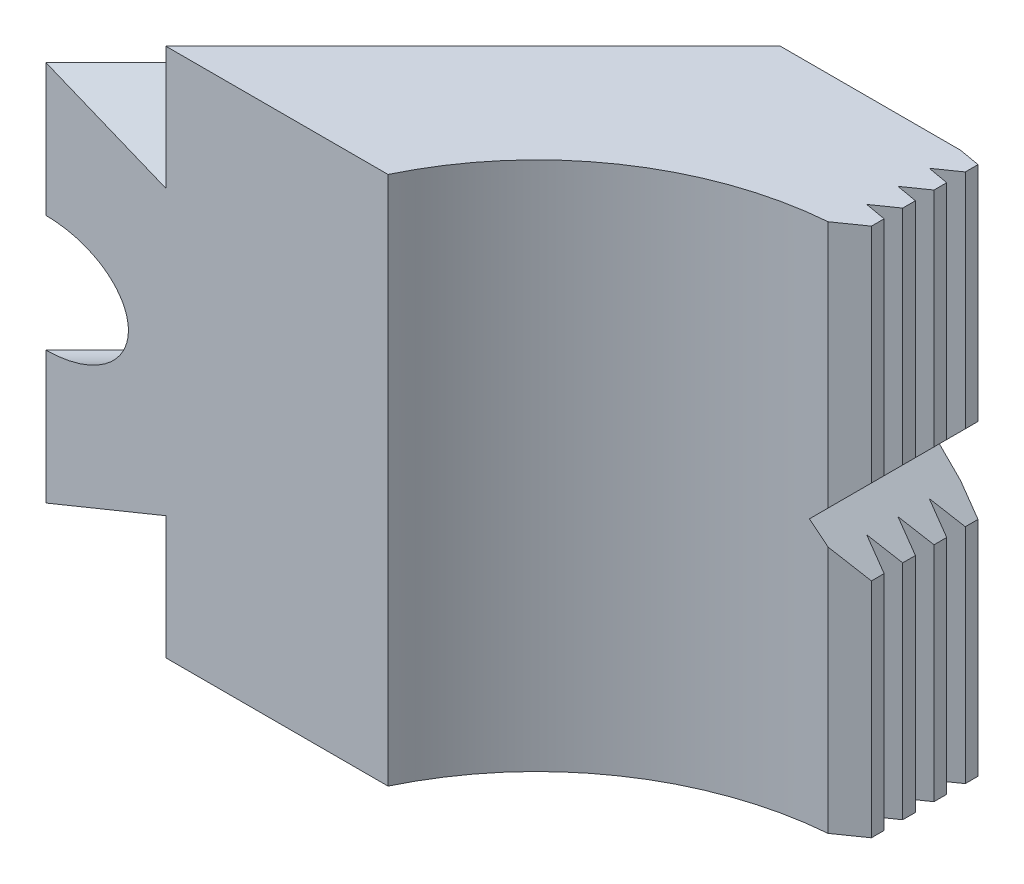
ISO-10303-21;
HEADER;
FILE_DESCRIPTION(('STEP AP214'),'2;1');
FILE_NAME('part.step','',(''),(''),'','','');
FILE_SCHEMA(('AUTOMOTIVE_DESIGN { 1 0 10303 214 1 1 1 1 }'));
ENDSEC;
DATA;
#1=APPLICATION_CONTEXT('core data for automotive mechanical design processes');
#2=APPLICATION_PROTOCOL_DEFINITION('international standard','automotive_design',2000,#1);
#3=PRODUCT_CONTEXT('',#1,'mechanical');
#4=PRODUCT('Part','Part','',(#3));
#5=PRODUCT_RELATED_PRODUCT_CATEGORY('part','',(#4));
#6=PRODUCT_DEFINITION_FORMATION('','',#4);
#7=PRODUCT_DEFINITION_CONTEXT('part definition',#1,'design');
#8=PRODUCT_DEFINITION('design','',#6,#7);
#9=PRODUCT_DEFINITION_SHAPE('','',#8);
#10=(LENGTH_UNIT() NAMED_UNIT(*) SI_UNIT(.MILLI.,.METRE.));
#11=(NAMED_UNIT(*) PLANE_ANGLE_UNIT() SI_UNIT($,.RADIAN.));
#12=(NAMED_UNIT(*) SI_UNIT($,.STERADIAN.) SOLID_ANGLE_UNIT());
#13=UNCERTAINTY_MEASURE_WITH_UNIT(LENGTH_MEASURE(1.E-05),#10,'distance_accuracy_value','');
#14=(GEOMETRIC_REPRESENTATION_CONTEXT(3) GLOBAL_UNCERTAINTY_ASSIGNED_CONTEXT((#13)) GLOBAL_UNIT_ASSIGNED_CONTEXT((#10,
#11,#12)) REPRESENTATION_CONTEXT('',''));
#15=CARTESIAN_POINT('',(0.,0.,0.));
#16=DIRECTION('',(0.,0.,1.));
#17=DIRECTION('',(1.,0.,0.));
#18=AXIS2_PLACEMENT_3D('',#15,#16,#17);
#19=CARTESIAN_POINT('',(-84.343578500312,6.69059892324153,90.0004329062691));
#20=DIRECTION('',(-0.707106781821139,0.,-0.707106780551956));
#21=DIRECTION('',(0.707106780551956,0.,-0.70710678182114));
#22=AXIS2_PLACEMENT_3D('',#19,#20,#21);
#23=PLANE('',#22);
#24=DIRECTION('',(0.,1.,0.));
#25=VECTOR('',#24,1.);
#26=CARTESIAN_POINT('',(5.65685424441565,12.5,0.));
#27=LINE('',#26,#25);
#28=CARTESIAN_POINT('',(5.65685424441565,6.69059892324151,0.));
#29=VERTEX_POINT('',#28);
#30=CARTESIAN_POINT('',(5.65685424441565,12.5,0.));
#31=VERTEX_POINT('',#30);
#32=EDGE_CURVE('E349',#29,#31,#27,.T.);
#33=ORIENTED_EDGE('',*,*,#32,.F.);
#34=DIRECTION('',(0.707106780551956,0.,-0.707106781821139));
#35=VECTOR('',#34,1.);
#36=CARTESIAN_POINT('',(-84.343578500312,6.69059892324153,90.0004329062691));
#37=LINE('',#36,#35);
#38=CARTESIAN_POINT('',(-8.8431457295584,6.69059892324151,14.5));
#39=VERTEX_POINT('',#38);
#40=EDGE_CURVE('E344',#39,#29,#37,.T.);
#41=ORIENTED_EDGE('',*,*,#40,.F.);
#42=DIRECTION('',(0.,-1.,0.));
#43=VECTOR('',#42,1.);
#44=CARTESIAN_POINT('',(-8.8431457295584,12.5,14.5));
#45=LINE('',#44,#43);
#46=CARTESIAN_POINT('',(-8.8431457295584,12.5,14.5));
#47=VERTEX_POINT('',#46);
#48=EDGE_CURVE('E337',#47,#39,#45,.T.);
#49=ORIENTED_EDGE('',*,*,#48,.F.);
#50=DIRECTION('',(-0.707106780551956,0.,0.70710678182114));
#51=VECTOR('',#50,1.);
#52=CARTESIAN_POINT('',(-0.0915728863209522,12.5,5.74842714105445));
#53=LINE('',#52,#51);
#54=EDGE_CURVE('E319',#31,#47,#53,.T.);
#55=ORIENTED_EDGE('',*,*,#54,.F.);
#56=EDGE_LOOP('',(#33,#41,#49,#55));
#57=FACE_BOUND('',#56,.T.);
#58=ADVANCED_FACE('F14',(#57),#23,.T.);
#59=CARTESIAN_POINT('',(-84.343578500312,6.69059892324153,90.0004329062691));
#60=DIRECTION('',(0.353553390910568,0.86602540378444,0.353553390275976));
#61=DIRECTION('',(-0.925820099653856,0.377964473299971,0.));
#62=AXIS2_PLACEMENT_3D('',#59,#60,#61);
#63=PLANE('',#62);
#64=DIRECTION('',(0.925820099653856,-0.377964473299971,0.));
#65=VECTOR('',#64,1.);
#66=CARTESIAN_POINT('',(-1.22474487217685,9.50000000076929,0.));
#67=LINE('',#66,#65);
#68=CARTESIAN_POINT('',(0.,9.,0.));
#69=VERTEX_POINT('',#68);
#70=EDGE_CURVE('E366',#69,#29,#67,.T.);
#71=ORIENTED_EDGE('',*,*,#70,.F.);
#72=DIRECTION('',(0.707106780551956,0.,-0.707106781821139));
#73=VECTOR('',#72,1.);
#74=CARTESIAN_POINT('',(-87.1720056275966,9.,87.1720057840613));
#75=LINE('',#74,#73);
#76=CARTESIAN_POINT('',(-14.499999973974,9.,14.5));
#77=VERTEX_POINT('',#76);
#78=EDGE_CURVE('E346',#77,#69,#75,.T.);
#79=ORIENTED_EDGE('',*,*,#78,.F.);
#80=DIRECTION('',(-0.925820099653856,0.377964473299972,0.));
#81=VECTOR('',#80,1.);
#82=CARTESIAN_POINT('',(-1.88917844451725,3.85165366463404,14.5));
#83=LINE('',#82,#81);
#84=EDGE_CURVE('E22',#39,#77,#83,.T.);
#85=ORIENTED_EDGE('',*,*,#84,.F.);
#86=ORIENTED_EDGE('',*,*,#40,.T.);
#87=EDGE_LOOP('',(#71,#79,#85,#86));
#88=FACE_BOUND('',#87,.T.);
#89=ADVANCED_FACE('F343',(#88),#63,.T.);
#90=CARTESIAN_POINT('',(-84.343578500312,-6.69059892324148,90.0004329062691));
#91=DIRECTION('',(-0.707106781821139,0.,-0.707106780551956));
#92=DIRECTION('',(0.707106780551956,0.,-0.70710678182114));
#93=AXIS2_PLACEMENT_3D('',#90,#91,#92);
#94=PLANE('',#93);
#95=DIRECTION('',(0.,1.,0.));
#96=VECTOR('',#95,1.);
#97=CARTESIAN_POINT('',(5.65685424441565,12.5,0.));
#98=LINE('',#97,#96);
#99=CARTESIAN_POINT('',(5.65685424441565,-12.5,0.));
#100=VERTEX_POINT('',#99);
#101=CARTESIAN_POINT('',(5.6568542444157,-6.69059892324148,0.));
#102=VERTEX_POINT('',#101);
#103=EDGE_CURVE('E29',#100,#102,#98,.T.);
#104=ORIENTED_EDGE('',*,*,#103,.F.);
#105=DIRECTION('',(-0.707106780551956,0.,0.70710678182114));
#106=VECTOR('',#105,1.);
#107=CARTESIAN_POINT('',(-0.0915728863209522,-12.5,5.74842714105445));
#108=LINE('',#107,#106);
#109=CARTESIAN_POINT('',(-8.8431457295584,-12.5,14.5));
#110=VERTEX_POINT('',#109);
#111=EDGE_CURVE('E327',#100,#110,#108,.T.);
#112=ORIENTED_EDGE('',*,*,#111,.T.);
#113=DIRECTION('',(0.,-1.,0.));
#114=VECTOR('',#113,1.);
#115=CARTESIAN_POINT('',(-8.8431457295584,12.5,14.5));
#116=LINE('',#115,#114);
#117=CARTESIAN_POINT('',(-8.8431457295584,-6.69059892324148,14.5));
#118=VERTEX_POINT('',#117);
#119=EDGE_CURVE('E362',#118,#110,#116,.T.);
#120=ORIENTED_EDGE('',*,*,#119,.F.);
#121=DIRECTION('',(0.707106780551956,0.,-0.707106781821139));
#122=VECTOR('',#121,1.);
#123=CARTESIAN_POINT('',(-84.343578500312,-6.69059892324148,90.0004329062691));
#124=LINE('',#123,#122);
#125=EDGE_CURVE('E357',#118,#102,#124,.T.);
#126=ORIENTED_EDGE('',*,*,#125,.T.);
#127=EDGE_LOOP('',(#104,#112,#120,#126));
#128=FACE_BOUND('',#127,.T.);
#129=ADVANCED_FACE('F685',(#128),#94,.T.);
#130=CARTESIAN_POINT('',(-84.343578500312,-6.69059892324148,90.0004329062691));
#131=DIRECTION('',(0.353553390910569,-0.86602540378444,0.353553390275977));
#132=DIRECTION('',(0.925820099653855,0.377964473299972,0.));
#133=AXIS2_PLACEMENT_3D('',#130,#131,#132);
#134=PLANE('',#133);
#135=DIRECTION('',(-0.925820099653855,-0.377964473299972,0.));
#136=VECTOR('',#135,1.);
#137=CARTESIAN_POINT('',(7.52343278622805,-5.92857142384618,0.));
#138=LINE('',#137,#136);
#139=CARTESIAN_POINT('',(0.,-9.,0.));
#140=VERTEX_POINT('',#139);
#141=EDGE_CURVE('E368',#102,#140,#138,.T.);
#142=ORIENTED_EDGE('',*,*,#141,.F.);
#143=ORIENTED_EDGE('',*,*,#125,.F.);
#144=DIRECTION('',(0.925820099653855,0.377964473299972,0.));
#145=VECTOR('',#144,1.);
#146=CARTESIAN_POINT('',(6.8589992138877,-0.280225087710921,14.5));
#147=LINE('',#146,#145);
#148=CARTESIAN_POINT('',(-14.499999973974,-9.,14.5));
#149=VERTEX_POINT('',#148);
#150=EDGE_CURVE('E9',#149,#118,#147,.T.);
#151=ORIENTED_EDGE('',*,*,#150,.F.);
#152=DIRECTION('',(0.707106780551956,0.,-0.707106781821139));
#153=VECTOR('',#152,1.);
#154=CARTESIAN_POINT('',(-87.1720056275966,-9.,87.1720057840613));
#155=LINE('',#154,#153);
#156=EDGE_CURVE('E351',#149,#140,#155,.T.);
#157=ORIENTED_EDGE('',*,*,#156,.T.);
#158=EDGE_LOOP('',(#142,#143,#151,#157));
#159=FACE_BOUND('',#158,.T.);
#160=ADVANCED_FACE('F687',(#159),#134,.T.);
#161=CARTESIAN_POINT('',(-2.01227923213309E-13,12.5,0.));
#162=DIRECTION('',(0.,0.,-1.));
#163=DIRECTION('',(-1.,0.,0.));
#164=AXIS2_PLACEMENT_3D('',#161,#162,#163);
#165=PLANE('',#164);
#166=DIRECTION('',(1.,0.,0.));
#167=VECTOR('',#166,1.);
#168=CARTESIAN_POINT('',(-2.01227923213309E-13,-12.5,0.));
#169=LINE('',#168,#167);
#170=CARTESIAN_POINT('',(14.1599999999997,-12.5,0.));
#171=VERTEX_POINT('',#170);
#172=EDGE_CURVE('E484',#100,#171,#169,.T.);
#173=ORIENTED_EDGE('',*,*,#172,.F.);
#174=ORIENTED_EDGE('',*,*,#103,.T.);
#175=ORIENTED_EDGE('',*,*,#141,.T.);
#176=DIRECTION('',(0.,-1.,0.));
#177=VECTOR('',#176,1.);
#178=CARTESIAN_POINT('',(-2.01227923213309E-13,12.5,0.));
#179=LINE('',#178,#177);
#180=EDGE_CURVE('E37',#69,#140,#179,.T.);
#181=ORIENTED_EDGE('',*,*,#180,.F.);
#182=ORIENTED_EDGE('',*,*,#70,.T.);
#183=ORIENTED_EDGE('',*,*,#32,.T.);
#184=DIRECTION('',(1.,0.,0.));
#185=VECTOR('',#184,1.);
#186=CARTESIAN_POINT('',(-2.01227923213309E-13,12.5,0.));
#187=LINE('',#186,#185);
#188=CARTESIAN_POINT('',(14.1599999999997,12.5,0.));
#189=VERTEX_POINT('',#188);
#190=EDGE_CURVE('E527',#31,#189,#187,.T.);
#191=ORIENTED_EDGE('',*,*,#190,.T.);
#192=DIRECTION('',(0.,-1.,0.));
#193=VECTOR('',#192,1.);
#194=CARTESIAN_POINT('',(14.1599999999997,12.5,0.));
#195=LINE('',#194,#193);
#196=CARTESIAN_POINT('',(14.1599999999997,0.999999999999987,0.));
#197=VERTEX_POINT('',#196);
#198=EDGE_CURVE('E533',#189,#197,#195,.T.);
#199=ORIENTED_EDGE('',*,*,#198,.T.);
#200=DIRECTION('',(-0.707106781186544,-0.707106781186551,0.));
#201=VECTOR('',#200,1.);
#202=CARTESIAN_POINT('',(15.4999999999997,2.34,0.));
#203=LINE('',#202,#201);
#204=CARTESIAN_POINT('',(13.1599999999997,0.,0.));
#205=VERTEX_POINT('',#204);
#206=EDGE_CURVE('E370',#197,#205,#203,.T.);
#207=ORIENTED_EDGE('',*,*,#206,.T.);
#208=DIRECTION('',(-0.707106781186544,0.707106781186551,0.));
#209=VECTOR('',#208,1.);
#210=CARTESIAN_POINT('',(15.4999999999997,-2.34,0.));
#211=LINE('',#210,#209);
#212=CARTESIAN_POINT('',(14.1599999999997,-1.,0.));
#213=VERTEX_POINT('',#212);
#214=EDGE_CURVE('E371',#213,#205,#211,.T.);
#215=ORIENTED_EDGE('',*,*,#214,.F.);
#216=EDGE_CURVE('E532',#213,#171,#195,.T.);
#217=ORIENTED_EDGE('',*,*,#216,.T.);
#218=EDGE_LOOP('',(#173,#174,#175,#181,#182,#183,#191,#199,#207,#215,#217));
#219=FACE_BOUND('',#218,.T.);
#220=ADVANCED_FACE('F691',(#219),#165,.T.);
#221=CARTESIAN_POINT('',(1.6414941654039,12.5,14.5));
#222=DIRECTION('',(0.,0.,1.));
#223=DIRECTION('',(1.,0.,0.));
#224=AXIS2_PLACEMENT_3D('',#221,#222,#223);
#225=PLANE('',#224);
#226=ORIENTED_EDGE('',*,*,#150,.T.);
#227=ORIENTED_EDGE('',*,*,#119,.T.);
#228=DIRECTION('',(-1.,0.,0.));
#229=VECTOR('',#228,1.);
#230=CARTESIAN_POINT('',(1.6414941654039,-12.5,14.5));
#231=LINE('',#230,#229);
#232=CARTESIAN_POINT('',(1.6414941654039,-12.5,14.5));
#233=VERTEX_POINT('',#232);
#234=EDGE_CURVE('E443',#233,#110,#231,.T.);
#235=ORIENTED_EDGE('',*,*,#234,.F.);
#236=DIRECTION('',(0.,-1.,0.));
#237=VECTOR('',#236,1.);
#238=CARTESIAN_POINT('',(1.6414941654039,12.5,14.5));
#239=LINE('',#238,#237);
#240=CARTESIAN_POINT('',(1.6414941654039,12.5,14.5));
#241=VERTEX_POINT('',#240);
#242=EDGE_CURVE('E304',#241,#233,#239,.T.);
#243=ORIENTED_EDGE('',*,*,#242,.F.);
#244=DIRECTION('',(-1.,0.,0.));
#245=VECTOR('',#244,1.);
#246=CARTESIAN_POINT('',(1.6414941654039,12.5,14.5));
#247=LINE('',#246,#245);
#248=EDGE_CURVE('E447',#241,#47,#247,.T.);
#249=ORIENTED_EDGE('',*,*,#248,.T.);
#250=ORIENTED_EDGE('',*,*,#48,.T.);
#251=ORIENTED_EDGE('',*,*,#84,.T.);
#252=DIRECTION('',(0.,-1.,0.));
#253=VECTOR('',#252,1.);
#254=CARTESIAN_POINT('',(-14.5000000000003,12.5,14.5));
#255=LINE('',#254,#253);
#256=CARTESIAN_POINT('',(-14.5000000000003,2.75,14.5));
#257=VERTEX_POINT('',#256);
#258=EDGE_CURVE('E334',#77,#257,#255,.T.);
#259=ORIENTED_EDGE('',*,*,#258,.T.);
#260=CARTESIAN_POINT('',(-14.5000000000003,0.,14.5));
#261=DIRECTION('',(0.,0.,1.));
#262=DIRECTION('',(-1.,0.,0.));
#263=AXIS2_PLACEMENT_3D('',#260,#261,#262);
#264=ELLIPSE('',#263,3.88908729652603,2.75);
#265=CARTESIAN_POINT('',(-14.5000000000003,-2.75,14.5));
#266=VERTEX_POINT('',#265);
#267=EDGE_CURVE('E441',#266,#257,#264,.T.);
#268=ORIENTED_EDGE('',*,*,#267,.F.);
#269=EDGE_CURVE('E490',#266,#149,#255,.T.);
#270=ORIENTED_EDGE('',*,*,#269,.T.);
#271=EDGE_LOOP('',(#226,#227,#235,#243,#249,#250,#251,#259,#268,#270));
#272=FACE_BOUND('',#271,.T.);
#273=ADVANCED_FACE('F332',(#272),#225,.T.);
#274=CARTESIAN_POINT('',(15.1599999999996,-12.5,21.));
#275=DIRECTION('',(0.,1.,0.));
#276=DIRECTION('',(0.,0.,1.));
#277=AXIS2_PLACEMENT_3D('',#274,#275,#276);
#278=PLANE('',#277);
#279=ORIENTED_EDGE('',*,*,#111,.F.);
#280=ORIENTED_EDGE('',*,*,#172,.T.);
#281=DIRECTION('',(0.984807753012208,0.,0.173648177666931));
#282=VECTOR('',#281,1.);
#283=CARTESIAN_POINT('',(14.1599999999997,-12.5,0.));
#284=LINE('',#283,#282);
#285=CARTESIAN_POINT('',(15.1599999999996,-12.5,0.176326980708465));
#286=VERTEX_POINT('',#285);
#287=EDGE_CURVE('E481',#171,#286,#284,.T.);
#288=ORIENTED_EDGE('',*,*,#287,.T.);
#289=DIRECTION('',(0.,0.,1.));
#290=VECTOR('',#289,1.);
#291=CARTESIAN_POINT('',(15.1599999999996,-12.5,0.176326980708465));
#292=LINE('',#291,#290);
#293=CARTESIAN_POINT('',(15.1599999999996,-12.5,0.776326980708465));
#294=VERTEX_POINT('',#293);
#295=EDGE_CURVE('E478',#286,#294,#292,.T.);
#296=ORIENTED_EDGE('',*,*,#295,.T.);
#297=DIRECTION('',(-0.819152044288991,0.,0.573576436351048));
#298=VECTOR('',#297,1.);
#299=CARTESIAN_POINT('',(15.1599999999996,-12.5,0.776326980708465));
#300=LINE('',#299,#298);
#301=CARTESIAN_POINT('',(14.1599999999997,-12.5,1.47653451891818));
#302=VERTEX_POINT('',#301);
#303=EDGE_CURVE('E475',#294,#302,#300,.T.);
#304=ORIENTED_EDGE('',*,*,#303,.T.);
#305=DIRECTION('',(0.984807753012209,0.,0.173648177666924));
#306=VECTOR('',#305,1.);
#307=CARTESIAN_POINT('',(14.1599999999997,-12.5,1.47653451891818));
#308=LINE('',#307,#306);
#309=CARTESIAN_POINT('',(15.1599999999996,-12.5,1.65286149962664));
#310=VERTEX_POINT('',#309);
#311=EDGE_CURVE('E472',#302,#310,#308,.T.);
#312=ORIENTED_EDGE('',*,*,#311,.T.);
#313=DIRECTION('',(0.,0.,1.));
#314=VECTOR('',#313,1.);
#315=CARTESIAN_POINT('',(15.1599999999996,-12.5,1.65286149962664));
#316=LINE('',#315,#314);
#317=CARTESIAN_POINT('',(15.1599999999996,-12.5,2.25286149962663));
#318=VERTEX_POINT('',#317);
#319=EDGE_CURVE('E469',#310,#318,#316,.T.);
#320=ORIENTED_EDGE('',*,*,#319,.T.);
#321=DIRECTION('',(-0.819152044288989,0.,0.57357643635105));
#322=VECTOR('',#321,1.);
#323=CARTESIAN_POINT('',(15.1599999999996,-12.5,2.25286149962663));
#324=LINE('',#323,#322);
#325=CARTESIAN_POINT('',(14.1599999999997,-12.5,2.95306903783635));
#326=VERTEX_POINT('',#325);
#327=EDGE_CURVE('E466',#318,#326,#324,.T.);
#328=ORIENTED_EDGE('',*,*,#327,.T.);
#329=DIRECTION('',(0.984807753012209,0.,0.173648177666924));
#330=VECTOR('',#329,1.);
#331=CARTESIAN_POINT('',(14.1599999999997,-12.5,2.95306903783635));
#332=LINE('',#331,#330);
#333=CARTESIAN_POINT('',(15.1599999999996,-12.5,3.12939601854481));
#334=VERTEX_POINT('',#333);
#335=EDGE_CURVE('E463',#326,#334,#332,.T.);
#336=ORIENTED_EDGE('',*,*,#335,.T.);
#337=DIRECTION('',(0.,0.,1.));
#338=VECTOR('',#337,1.);
#339=CARTESIAN_POINT('',(15.1599999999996,-12.5,3.12939601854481));
#340=LINE('',#339,#338);
#341=CARTESIAN_POINT('',(15.1599999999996,-12.5,3.72939601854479));
#342=VERTEX_POINT('',#341);
#343=EDGE_CURVE('E460',#334,#342,#340,.T.);
#344=ORIENTED_EDGE('',*,*,#343,.T.);
#345=DIRECTION('',(-0.819152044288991,0.,0.573576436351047));
#346=VECTOR('',#345,1.);
#347=CARTESIAN_POINT('',(15.1599999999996,-12.5,3.72939601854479));
#348=LINE('',#347,#346);
#349=CARTESIAN_POINT('',(14.1599999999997,-12.5,4.4296035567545));
#350=VERTEX_POINT('',#349);
#351=EDGE_CURVE('E457',#342,#350,#348,.T.);
#352=ORIENTED_EDGE('',*,*,#351,.T.);
#353=DIRECTION('',(0.984807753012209,0.,0.173648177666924));
#354=VECTOR('',#353,1.);
#355=CARTESIAN_POINT('',(14.1599999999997,-12.5,4.4296035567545));
#356=LINE('',#355,#354);
#357=CARTESIAN_POINT('',(15.1599999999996,-12.5,4.60593053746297));
#358=VERTEX_POINT('',#357);
#359=EDGE_CURVE('E454',#350,#358,#356,.T.);
#360=ORIENTED_EDGE('',*,*,#359,.T.);
#361=DIRECTION('',(0.,0.,1.));
#362=VECTOR('',#361,1.);
#363=CARTESIAN_POINT('',(15.1599999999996,-12.5,4.60593053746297));
#364=LINE('',#363,#362);
#365=CARTESIAN_POINT('',(15.1599999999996,-12.5,5.20593053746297));
#366=VERTEX_POINT('',#365);
#367=EDGE_CURVE('E451',#358,#366,#364,.T.);
#368=ORIENTED_EDGE('',*,*,#367,.T.);
#369=DIRECTION('',(-0.81915204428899,0.,0.573576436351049));
#370=VECTOR('',#369,1.);
#371=CARTESIAN_POINT('',(15.1599999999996,-12.5,5.20593053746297));
#372=LINE('',#371,#370);
#373=CARTESIAN_POINT('',(13.9569388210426,-12.5,6.04832304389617));
#374=VERTEX_POINT('',#373);
#375=EDGE_CURVE('E448',#366,#374,#372,.T.);
#376=ORIENTED_EDGE('',*,*,#375,.T.);
#377=CARTESIAN_POINT('',(15.1599999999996,-12.5,21.));
#378=DIRECTION('',(0.,1.,0.));
#379=DIRECTION('',(0.,0.,1.));
#380=AXIS2_PLACEMENT_3D('',#377,#378,#379);
#381=CIRCLE('',#380,15.);
#382=EDGE_CURVE('E444',#374,#233,#381,.T.);
#383=ORIENTED_EDGE('',*,*,#382,.T.);
#384=ORIENTED_EDGE('',*,*,#234,.T.);
#385=EDGE_LOOP('',(#279,#280,#288,#296,#304,#312,#320,#328,#336,#344,#352,#360,#368,#376,#383,#384));
#386=FACE_BOUND('',#385,.T.);
#387=ADVANCED_FACE('F709',(#386),#278,.F.);
#388=CARTESIAN_POINT('',(15.1599999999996,12.5,21.));
#389=DIRECTION('',(0.,1.,0.));
#390=DIRECTION('',(0.,0.,1.));
#391=AXIS2_PLACEMENT_3D('',#388,#389,#390);
#392=PLANE('',#391);
#393=ORIENTED_EDGE('',*,*,#190,.F.);
#394=ORIENTED_EDGE('',*,*,#54,.T.);
#395=ORIENTED_EDGE('',*,*,#248,.F.);
#396=CARTESIAN_POINT('',(15.1599999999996,12.5,21.));
#397=DIRECTION('',(0.,1.,0.));
#398=DIRECTION('',(0.,0.,1.));
#399=AXIS2_PLACEMENT_3D('',#396,#397,#398);
#400=CIRCLE('',#399,15.);
#401=CARTESIAN_POINT('',(13.9569388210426,12.5,6.04832304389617));
#402=VERTEX_POINT('',#401);
#403=EDGE_CURVE('E487',#402,#241,#400,.T.);
#404=ORIENTED_EDGE('',*,*,#403,.F.);
#405=DIRECTION('',(-0.81915204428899,0.,0.573576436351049));
#406=VECTOR('',#405,1.);
#407=CARTESIAN_POINT('',(15.1599999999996,12.5,5.20593053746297));
#408=LINE('',#407,#406);
#409=CARTESIAN_POINT('',(15.1599999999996,12.5,5.20593053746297));
#410=VERTEX_POINT('',#409);
#411=EDGE_CURVE('E491',#410,#402,#408,.T.);
#412=ORIENTED_EDGE('',*,*,#411,.F.);
#413=DIRECTION('',(0.,0.,1.));
#414=VECTOR('',#413,1.);
#415=CARTESIAN_POINT('',(15.1599999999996,12.5,4.60593053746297));
#416=LINE('',#415,#414);
#417=CARTESIAN_POINT('',(15.1599999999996,12.5,4.60593053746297));
#418=VERTEX_POINT('',#417);
#419=EDGE_CURVE('E494',#418,#410,#416,.T.);
#420=ORIENTED_EDGE('',*,*,#419,.F.);
#421=DIRECTION('',(0.984807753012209,0.,0.173648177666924));
#422=VECTOR('',#421,1.);
#423=CARTESIAN_POINT('',(14.1599999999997,12.5,4.4296035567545));
#424=LINE('',#423,#422);
#425=CARTESIAN_POINT('',(14.1599999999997,12.5,4.4296035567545));
#426=VERTEX_POINT('',#425);
#427=EDGE_CURVE('E497',#426,#418,#424,.T.);
#428=ORIENTED_EDGE('',*,*,#427,.F.);
#429=DIRECTION('',(-0.819152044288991,0.,0.573576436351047));
#430=VECTOR('',#429,1.);
#431=CARTESIAN_POINT('',(15.1599999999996,12.5,3.72939601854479));
#432=LINE('',#431,#430);
#433=CARTESIAN_POINT('',(15.1599999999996,12.5,3.72939601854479));
#434=VERTEX_POINT('',#433);
#435=EDGE_CURVE('E500',#434,#426,#432,.T.);
#436=ORIENTED_EDGE('',*,*,#435,.F.);
#437=DIRECTION('',(0.,0.,1.));
#438=VECTOR('',#437,1.);
#439=CARTESIAN_POINT('',(15.1599999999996,12.5,3.12939601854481));
#440=LINE('',#439,#438);
#441=CARTESIAN_POINT('',(15.1599999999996,12.5,3.12939601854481));
#442=VERTEX_POINT('',#441);
#443=EDGE_CURVE('E503',#442,#434,#440,.T.);
#444=ORIENTED_EDGE('',*,*,#443,.F.);
#445=DIRECTION('',(0.984807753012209,0.,0.173648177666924));
#446=VECTOR('',#445,1.);
#447=CARTESIAN_POINT('',(14.1599999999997,12.5,2.95306903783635));
#448=LINE('',#447,#446);
#449=CARTESIAN_POINT('',(14.1599999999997,12.5,2.95306903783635));
#450=VERTEX_POINT('',#449);
#451=EDGE_CURVE('E506',#450,#442,#448,.T.);
#452=ORIENTED_EDGE('',*,*,#451,.F.);
#453=DIRECTION('',(-0.819152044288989,0.,0.57357643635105));
#454=VECTOR('',#453,1.);
#455=CARTESIAN_POINT('',(15.1599999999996,12.5,2.25286149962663));
#456=LINE('',#455,#454);
#457=CARTESIAN_POINT('',(15.1599999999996,12.5,2.25286149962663));
#458=VERTEX_POINT('',#457);
#459=EDGE_CURVE('E509',#458,#450,#456,.T.);
#460=ORIENTED_EDGE('',*,*,#459,.F.);
#461=DIRECTION('',(0.,0.,1.));
#462=VECTOR('',#461,1.);
#463=CARTESIAN_POINT('',(15.1599999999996,12.5,1.65286149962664));
#464=LINE('',#463,#462);
#465=CARTESIAN_POINT('',(15.1599999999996,12.5,1.65286149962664));
#466=VERTEX_POINT('',#465);
#467=EDGE_CURVE('E512',#466,#458,#464,.T.);
#468=ORIENTED_EDGE('',*,*,#467,.F.);
#469=DIRECTION('',(0.984807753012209,0.,0.173648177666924));
#470=VECTOR('',#469,1.);
#471=CARTESIAN_POINT('',(14.1599999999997,12.5,1.47653451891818));
#472=LINE('',#471,#470);
#473=CARTESIAN_POINT('',(14.1599999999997,12.5,1.47653451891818));
#474=VERTEX_POINT('',#473);
#475=EDGE_CURVE('E515',#474,#466,#472,.T.);
#476=ORIENTED_EDGE('',*,*,#475,.F.);
#477=DIRECTION('',(-0.819152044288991,0.,0.573576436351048));
#478=VECTOR('',#477,1.);
#479=CARTESIAN_POINT('',(15.1599999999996,12.5,0.776326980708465));
#480=LINE('',#479,#478);
#481=CARTESIAN_POINT('',(15.1599999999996,12.5,0.776326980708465));
#482=VERTEX_POINT('',#481);
#483=EDGE_CURVE('E518',#482,#474,#480,.T.);
#484=ORIENTED_EDGE('',*,*,#483,.F.);
#485=DIRECTION('',(0.,0.,1.));
#486=VECTOR('',#485,1.);
#487=CARTESIAN_POINT('',(15.1599999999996,12.5,0.176326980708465));
#488=LINE('',#487,#486);
#489=CARTESIAN_POINT('',(15.1599999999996,12.5,0.176326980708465));
#490=VERTEX_POINT('',#489);
#491=EDGE_CURVE('E521',#490,#482,#488,.T.);
#492=ORIENTED_EDGE('',*,*,#491,.F.);
#493=DIRECTION('',(0.984807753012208,0.,0.173648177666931));
#494=VECTOR('',#493,1.);
#495=CARTESIAN_POINT('',(14.1599999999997,12.5,0.));
#496=LINE('',#495,#494);
#497=EDGE_CURVE('E524',#189,#490,#496,.T.);
#498=ORIENTED_EDGE('',*,*,#497,.F.);
#499=EDGE_LOOP('',(#393,#394,#395,#404,#412,#420,#428,#436,#444,#452,#460,#468,#476,#484,#492,#498));
#500=FACE_BOUND('',#499,.T.);
#501=ADVANCED_FACE('F712',(#500),#392,.T.);
#502=CARTESIAN_POINT('',(-14.5000000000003,12.5,14.5));
#503=DIRECTION('',(-0.707106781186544,0.,-0.707106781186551));
#504=DIRECTION('',(-0.707106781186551,0.,0.707106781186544));
#505=AXIS2_PLACEMENT_3D('',#502,#503,#504);
#506=PLANE('',#505);
#507=DIRECTION('',(0.,1.,0.));
#508=VECTOR('',#507,1.);
#509=CARTESIAN_POINT('',(-9.9038059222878,12.5,9.90380592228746));
#510=LINE('',#509,#508);
#511=CARTESIAN_POINT('',(-9.9038059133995,-5.,9.9038059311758));
#512=VERTEX_POINT('',#511);
#513=CARTESIAN_POINT('',(-9.9038059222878,-2.75,9.90380592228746));
#514=VERTEX_POINT('',#513);
#515=EDGE_CURVE('E310',#512,#514,#510,.T.);
#516=ORIENTED_EDGE('',*,*,#515,.F.);
#517=DIRECTION('',(0.707106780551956,0.,-0.70710678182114));
#518=VECTOR('',#517,1.);
#519=CARTESIAN_POINT('',(-9.9038058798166,-5.00000000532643,9.90380589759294));
#520=LINE('',#519,#518);
#521=CARTESIAN_POINT('',(-2.83273807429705,-5.00000000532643,2.83273807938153));
#522=VERTEX_POINT('',#521);
#523=EDGE_CURVE('E307',#522,#512,#520,.F.);
#524=ORIENTED_EDGE('',*,*,#523,.F.);
#525=DIRECTION('',(0.,-1.,0.));
#526=VECTOR('',#525,1.);
#527=CARTESIAN_POINT('',(-2.8327381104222,12.5,2.83273811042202));
#528=LINE('',#527,#526);
#529=CARTESIAN_POINT('',(-2.8327381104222,5.,2.83273811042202));
#530=VERTEX_POINT('',#529);
#531=EDGE_CURVE('E297',#530,#522,#528,.T.);
#532=ORIENTED_EDGE('',*,*,#531,.F.);
#533=DIRECTION('',(0.707106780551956,0.,-0.70710678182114));
#534=VECTOR('',#533,1.);
#535=CARTESIAN_POINT('',(-9.9038058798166,4.99999999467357,9.90380589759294));
#536=LINE('',#535,#534);
#537=CARTESIAN_POINT('',(-9.9038058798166,5.,9.90380589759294));
#538=VERTEX_POINT('',#537);
#539=EDGE_CURVE('E314',#538,#530,#536,.T.);
#540=ORIENTED_EDGE('',*,*,#539,.F.);
#541=CARTESIAN_POINT('',(-9.9038058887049,2.75,9.9038058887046));
#542=VERTEX_POINT('',#541);
#543=EDGE_CURVE('E303',#542,#538,#510,.T.);
#544=ORIENTED_EDGE('',*,*,#543,.F.);
#545=DIRECTION('',(-0.707106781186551,0.,0.707106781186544));
#546=VECTOR('',#545,1.);
#547=CARTESIAN_POINT('',(-21.3921356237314,2.75,21.3921356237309));
#548=LINE('',#547,#546);
#549=EDGE_CURVE('E586',#257,#542,#548,.F.);
#550=ORIENTED_EDGE('',*,*,#549,.F.);
#551=ORIENTED_EDGE('',*,*,#258,.F.);
#552=ORIENTED_EDGE('',*,*,#78,.T.);
#553=ORIENTED_EDGE('',*,*,#180,.T.);
#554=ORIENTED_EDGE('',*,*,#156,.F.);
#555=ORIENTED_EDGE('',*,*,#269,.F.);
#556=DIRECTION('',(-0.707106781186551,0.,0.707106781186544));
#557=VECTOR('',#556,1.);
#558=CARTESIAN_POINT('',(-21.3921356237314,-2.75,21.3921356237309));
#559=LINE('',#558,#557);
#560=EDGE_CURVE('E589',#514,#266,#559,.T.);
#561=ORIENTED_EDGE('',*,*,#560,.F.);
#562=EDGE_LOOP('',(#516,#524,#532,#540,#544,#550,#551,#552,#553,#554,#555,#561));
#563=FACE_BOUND('',#562,.T.);
#564=ADVANCED_FACE('F308',(#563),#506,.T.);
#565=CARTESIAN_POINT('',(15.1599999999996,12.5,21.));
#566=DIRECTION('',(0.,-1.,0.));
#567=DIRECTION('',(0.,0.,-1.));
#568=AXIS2_PLACEMENT_3D('',#565,#566,#567);
#569=CYLINDRICAL_SURFACE('',#568,15.);
#570=CARTESIAN_POINT('',(15.1599999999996,-2.,21.));
#571=DIRECTION('',(-0.707106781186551,-0.707106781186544,0.));
#572=DIRECTION('',(0.707106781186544,-0.707106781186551,0.));
#573=AXIS2_PLACEMENT_3D('',#570,#571,#572);
#574=ELLIPSE('',#573,21.2132034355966,15.);
#575=CARTESIAN_POINT('',(13.1599999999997,0.,6.13393125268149));
#576=VERTEX_POINT('',#575);
#577=CARTESIAN_POINT('',(13.9569388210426,-0.796938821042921,6.04832304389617));
#578=VERTEX_POINT('',#577);
#579=EDGE_CURVE('E400',#576,#578,#574,.T.);
#580=ORIENTED_EDGE('',*,*,#579,.F.);
#581=CARTESIAN_POINT('',(15.1599999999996,2.,21.));
#582=DIRECTION('',(0.707106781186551,-0.707106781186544,0.));
#583=DIRECTION('',(-0.707106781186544,-0.707106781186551,0.));
#584=AXIS2_PLACEMENT_3D('',#581,#582,#583);
#585=ELLIPSE('',#584,21.2132034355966,15.);
#586=CARTESIAN_POINT('',(13.9569388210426,0.796938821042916,6.04832304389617));
#587=VERTEX_POINT('',#586);
#588=EDGE_CURVE('E435',#576,#587,#585,.T.);
#589=ORIENTED_EDGE('',*,*,#588,.T.);
#590=DIRECTION('',(0.,-1.,0.));
#591=VECTOR('',#590,1.);
#592=CARTESIAN_POINT('',(13.9569388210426,12.5,6.04832304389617));
#593=LINE('',#592,#591);
#594=EDGE_CURVE('E581',#402,#587,#593,.T.);
#595=ORIENTED_EDGE('',*,*,#594,.F.);
#596=ORIENTED_EDGE('',*,*,#403,.T.);
#597=ORIENTED_EDGE('',*,*,#242,.T.);
#598=ORIENTED_EDGE('',*,*,#382,.F.);
#599=EDGE_CURVE('E580',#578,#374,#593,.T.);
#600=ORIENTED_EDGE('',*,*,#599,.F.);
#601=EDGE_LOOP('',(#580,#589,#595,#596,#597,#598,#600));
#602=FACE_BOUND('',#601,.T.);
#603=ADVANCED_FACE('F721',(#602),#569,.F.);
#604=CARTESIAN_POINT('',(15.1599999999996,12.5,5.20593053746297));
#605=DIRECTION('',(0.573576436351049,0.,0.81915204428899));
#606=DIRECTION('',(0.81915204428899,0.,-0.573576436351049));
#607=AXIS2_PLACEMENT_3D('',#604,#605,#606);
#608=PLANE('',#607);
#609=ORIENTED_EDGE('',*,*,#594,.T.);
#610=DIRECTION('',(0.633687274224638,0.633687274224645,-0.443712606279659));
#611=VECTOR('',#610,1.);
#612=CARTESIAN_POINT('',(19.3763753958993,6.21637539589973,2.25359270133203));
#613=LINE('',#612,#611);
#614=CARTESIAN_POINT('',(15.1599999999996,2.,5.20593053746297));
#615=VERTEX_POINT('',#614);
#616=EDGE_CURVE('E432',#587,#615,#613,.T.);
#617=ORIENTED_EDGE('',*,*,#616,.T.);
#618=DIRECTION('',(0.,-1.,0.));
#619=VECTOR('',#618,1.);
#620=CARTESIAN_POINT('',(15.1599999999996,12.5,5.20593053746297));
#621=LINE('',#620,#619);
#622=EDGE_CURVE('E577',#410,#615,#621,.T.);
#623=ORIENTED_EDGE('',*,*,#622,.F.);
#624=ORIENTED_EDGE('',*,*,#411,.T.);
#625=EDGE_LOOP('',(#609,#617,#623,#624));
#626=FACE_BOUND('',#625,.T.);
#627=ADVANCED_FACE('F782',(#626),#608,.T.);
#628=CARTESIAN_POINT('',(15.1599999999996,12.5,4.60593053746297));
#629=DIRECTION('',(1.,0.,0.));
#630=DIRECTION('',(0.,0.,-1.));
#631=AXIS2_PLACEMENT_3D('',#628,#629,#630);
#632=PLANE('',#631);
#633=ORIENTED_EDGE('',*,*,#622,.T.);
#634=DIRECTION('',(0.,0.,-1.));
#635=VECTOR('',#634,1.);
#636=CARTESIAN_POINT('',(15.1599999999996,2.,4.6059305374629));
#637=LINE('',#636,#635);
#638=CARTESIAN_POINT('',(15.1599999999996,2.,4.60593053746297));
#639=VERTEX_POINT('',#638);
#640=EDGE_CURVE('E429',#615,#639,#637,.T.);
#641=ORIENTED_EDGE('',*,*,#640,.T.);
#642=DIRECTION('',(0.,-1.,0.));
#643=VECTOR('',#642,1.);
#644=CARTESIAN_POINT('',(15.1599999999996,12.5,4.60593053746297));
#645=LINE('',#644,#643);
#646=EDGE_CURVE('E573',#418,#639,#645,.T.);
#647=ORIENTED_EDGE('',*,*,#646,.F.);
#648=ORIENTED_EDGE('',*,*,#419,.T.);
#649=EDGE_LOOP('',(#633,#641,#647,#648));
#650=FACE_BOUND('',#649,.T.);
#651=ADVANCED_FACE('F778',(#650),#632,.T.);
#652=CARTESIAN_POINT('',(14.1599999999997,12.5,4.4296035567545));
#653=DIRECTION('',(0.173648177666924,0.,-0.984807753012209));
#654=DIRECTION('',(-0.984807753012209,0.,-0.173648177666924));
#655=AXIS2_PLACEMENT_3D('',#652,#653,#654);
#656=PLANE('',#655);
#657=ORIENTED_EDGE('',*,*,#646,.T.);
#658=DIRECTION('',(-0.70167384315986,-0.701673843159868,-0.123724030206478));
#659=VECTOR('',#658,1.);
#660=CARTESIAN_POINT('',(19.8219810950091,6.66198109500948,5.42796358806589));
#661=LINE('',#660,#659);
#662=CARTESIAN_POINT('',(14.1599999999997,0.999999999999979,4.4296035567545));
#663=VERTEX_POINT('',#662);
#664=EDGE_CURVE('E426',#639,#663,#661,.T.);
#665=ORIENTED_EDGE('',*,*,#664,.T.);
#666=DIRECTION('',(0.,-1.,0.));
#667=VECTOR('',#666,1.);
#668=CARTESIAN_POINT('',(14.1599999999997,12.5,4.4296035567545));
#669=LINE('',#668,#667);
#670=EDGE_CURVE('E569',#426,#663,#669,.T.);
#671=ORIENTED_EDGE('',*,*,#670,.F.);
#672=ORIENTED_EDGE('',*,*,#427,.T.);
#673=EDGE_LOOP('',(#657,#665,#671,#672));
#674=FACE_BOUND('',#673,.T.);
#675=ADVANCED_FACE('F773',(#674),#656,.T.);
#676=CARTESIAN_POINT('',(15.1599999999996,12.5,3.72939601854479));
#677=DIRECTION('',(0.573576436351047,0.,0.819152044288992));
#678=DIRECTION('',(0.819152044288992,0.,-0.573576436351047));
#679=AXIS2_PLACEMENT_3D('',#676,#677,#678);
#680=PLANE('',#679);
#681=ORIENTED_EDGE('',*,*,#670,.T.);
#682=DIRECTION('',(0.633687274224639,0.633687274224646,-0.443712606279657));
#683=VECTOR('',#682,1.);
#684=CARTESIAN_POINT('',(19.3763753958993,6.21637539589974,0.77705818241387));
#685=LINE('',#684,#683);
#686=CARTESIAN_POINT('',(15.1599999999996,2.,3.72939601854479));
#687=VERTEX_POINT('',#686);
#688=EDGE_CURVE('E423',#663,#687,#685,.T.);
#689=ORIENTED_EDGE('',*,*,#688,.T.);
#690=DIRECTION('',(0.,-1.,0.));
#691=VECTOR('',#690,1.);
#692=CARTESIAN_POINT('',(15.1599999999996,12.5,3.72939601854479));
#693=LINE('',#692,#691);
#694=EDGE_CURVE('E565',#434,#687,#693,.T.);
#695=ORIENTED_EDGE('',*,*,#694,.F.);
#696=ORIENTED_EDGE('',*,*,#435,.T.);
#697=EDGE_LOOP('',(#681,#689,#695,#696));
#698=FACE_BOUND('',#697,.T.);
#699=ADVANCED_FACE('F768',(#698),#680,.T.);
#700=CARTESIAN_POINT('',(15.1599999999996,12.5,3.12939601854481));
#701=DIRECTION('',(1.,0.,0.));
#702=DIRECTION('',(0.,0.,-1.));
#703=AXIS2_PLACEMENT_3D('',#700,#701,#702);
#704=PLANE('',#703);
#705=ORIENTED_EDGE('',*,*,#694,.T.);
#706=DIRECTION('',(0.,0.,-1.));
#707=VECTOR('',#706,1.);
#708=CARTESIAN_POINT('',(15.1599999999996,2.,3.12939601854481));
#709=LINE('',#708,#707);
#710=CARTESIAN_POINT('',(15.1599999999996,2.,3.12939601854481));
#711=VERTEX_POINT('',#710);
#712=EDGE_CURVE('E420',#687,#711,#709,.T.);
#713=ORIENTED_EDGE('',*,*,#712,.T.);
#714=DIRECTION('',(0.,-1.,0.));
#715=VECTOR('',#714,1.);
#716=CARTESIAN_POINT('',(15.1599999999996,12.5,3.12939601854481));
#717=LINE('',#716,#715);
#718=EDGE_CURVE('E561',#442,#711,#717,.T.);
#719=ORIENTED_EDGE('',*,*,#718,.F.);
#720=ORIENTED_EDGE('',*,*,#443,.T.);
#721=EDGE_LOOP('',(#705,#713,#719,#720));
#722=FACE_BOUND('',#721,.T.);
#723=ADVANCED_FACE('F763',(#722),#704,.T.);
#724=CARTESIAN_POINT('',(14.1599999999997,12.5,2.95306903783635));
#725=DIRECTION('',(0.173648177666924,0.,-0.984807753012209));
#726=DIRECTION('',(-0.984807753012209,0.,-0.173648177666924));
#727=AXIS2_PLACEMENT_3D('',#724,#725,#726);
#728=PLANE('',#727);
#729=ORIENTED_EDGE('',*,*,#718,.T.);
#730=DIRECTION('',(-0.70167384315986,-0.701673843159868,-0.123724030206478));
#731=VECTOR('',#730,1.);
#732=CARTESIAN_POINT('',(19.8219810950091,6.66198109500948,3.95142906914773));
#733=LINE('',#732,#731);
#734=CARTESIAN_POINT('',(14.1599999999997,0.999999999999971,2.95306903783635));
#735=VERTEX_POINT('',#734);
#736=EDGE_CURVE('E417',#711,#735,#733,.T.);
#737=ORIENTED_EDGE('',*,*,#736,.T.);
#738=DIRECTION('',(0.,-1.,0.));
#739=VECTOR('',#738,1.);
#740=CARTESIAN_POINT('',(14.1599999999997,12.5,2.95306903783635));
#741=LINE('',#740,#739);
#742=EDGE_CURVE('E557',#450,#735,#741,.T.);
#743=ORIENTED_EDGE('',*,*,#742,.F.);
#744=ORIENTED_EDGE('',*,*,#451,.T.);
#745=EDGE_LOOP('',(#729,#737,#743,#744));
#746=FACE_BOUND('',#745,.T.);
#747=ADVANCED_FACE('F758',(#746),#728,.T.);
#748=CARTESIAN_POINT('',(15.1599999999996,12.5,2.25286149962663));
#749=DIRECTION('',(0.57357643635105,0.,0.819152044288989));
#750=DIRECTION('',(0.819152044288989,0.,-0.57357643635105));
#751=AXIS2_PLACEMENT_3D('',#748,#749,#750);
#752=PLANE('',#751);
#753=ORIENTED_EDGE('',*,*,#742,.T.);
#754=DIRECTION('',(0.633687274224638,0.633687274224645,-0.44371260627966));
#755=VECTOR('',#754,1.);
#756=CARTESIAN_POINT('',(19.3763753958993,6.21637539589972,-0.699476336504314));
#757=LINE('',#756,#755);
#758=CARTESIAN_POINT('',(15.1599999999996,2.,2.25286149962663));
#759=VERTEX_POINT('',#758);
#760=EDGE_CURVE('E414',#735,#759,#757,.T.);
#761=ORIENTED_EDGE('',*,*,#760,.T.);
#762=DIRECTION('',(0.,-1.,0.));
#763=VECTOR('',#762,1.);
#764=CARTESIAN_POINT('',(15.1599999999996,12.5,2.25286149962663));
#765=LINE('',#764,#763);
#766=EDGE_CURVE('E553',#458,#759,#765,.T.);
#767=ORIENTED_EDGE('',*,*,#766,.F.);
#768=ORIENTED_EDGE('',*,*,#459,.T.);
#769=EDGE_LOOP('',(#753,#761,#767,#768));
#770=FACE_BOUND('',#769,.T.);
#771=ADVANCED_FACE('F753',(#770),#752,.T.);
#772=CARTESIAN_POINT('',(15.1599999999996,12.5,1.65286149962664));
#773=DIRECTION('',(1.,0.,0.));
#774=DIRECTION('',(0.,0.,-1.));
#775=AXIS2_PLACEMENT_3D('',#772,#773,#774);
#776=PLANE('',#775);
#777=ORIENTED_EDGE('',*,*,#766,.T.);
#778=DIRECTION('',(0.,0.,-1.));
#779=VECTOR('',#778,1.);
#780=CARTESIAN_POINT('',(15.1599999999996,2.,1.65286149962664));
#781=LINE('',#780,#779);
#782=CARTESIAN_POINT('',(15.1599999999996,2.,1.65286149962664));
#783=VERTEX_POINT('',#782);
#784=EDGE_CURVE('E411',#759,#783,#781,.T.);
#785=ORIENTED_EDGE('',*,*,#784,.T.);
#786=DIRECTION('',(0.,-1.,0.));
#787=VECTOR('',#786,1.);
#788=CARTESIAN_POINT('',(15.1599999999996,12.5,1.65286149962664));
#789=LINE('',#788,#787);
#790=EDGE_CURVE('E549',#466,#783,#789,.T.);
#791=ORIENTED_EDGE('',*,*,#790,.F.);
#792=ORIENTED_EDGE('',*,*,#467,.T.);
#793=EDGE_LOOP('',(#777,#785,#791,#792));
#794=FACE_BOUND('',#793,.T.);
#795=ADVANCED_FACE('F748',(#794),#776,.T.);
#796=CARTESIAN_POINT('',(14.1599999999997,12.5,1.47653451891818));
#797=DIRECTION('',(0.173648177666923,0.,-0.984807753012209));
#798=DIRECTION('',(-0.984807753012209,0.,-0.173648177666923));
#799=AXIS2_PLACEMENT_3D('',#796,#797,#798);
#800=PLANE('',#799);
#801=ORIENTED_EDGE('',*,*,#790,.T.);
#802=DIRECTION('',(-0.70167384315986,-0.701673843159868,-0.123724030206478));
#803=VECTOR('',#802,1.);
#804=CARTESIAN_POINT('',(19.8219810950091,6.66198109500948,2.47489455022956));
#805=LINE('',#804,#803);
#806=CARTESIAN_POINT('',(14.1599999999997,0.999999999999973,1.47653451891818));
#807=VERTEX_POINT('',#806);
#808=EDGE_CURVE('E408',#783,#807,#805,.T.);
#809=ORIENTED_EDGE('',*,*,#808,.T.);
#810=DIRECTION('',(0.,-1.,0.));
#811=VECTOR('',#810,1.);
#812=CARTESIAN_POINT('',(14.1599999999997,12.5,1.47653451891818));
#813=LINE('',#812,#811);
#814=EDGE_CURVE('E545',#474,#807,#813,.T.);
#815=ORIENTED_EDGE('',*,*,#814,.F.);
#816=ORIENTED_EDGE('',*,*,#475,.T.);
#817=EDGE_LOOP('',(#801,#809,#815,#816));
#818=FACE_BOUND('',#817,.T.);
#819=ADVANCED_FACE('F743',(#818),#800,.T.);
#820=CARTESIAN_POINT('',(15.1599999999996,12.5,0.776326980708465));
#821=DIRECTION('',(0.573576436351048,0.,0.819152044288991));
#822=DIRECTION('',(0.819152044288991,0.,-0.573576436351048));
#823=AXIS2_PLACEMENT_3D('',#820,#821,#822);
#824=PLANE('',#823);
#825=ORIENTED_EDGE('',*,*,#814,.T.);
#826=DIRECTION('',(0.633687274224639,0.633687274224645,-0.443712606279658));
#827=VECTOR('',#826,1.);
#828=CARTESIAN_POINT('',(19.3763753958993,6.21637539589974,-2.17601085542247));
#829=LINE('',#828,#827);
#830=CARTESIAN_POINT('',(15.1599999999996,2.,0.776326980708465));
#831=VERTEX_POINT('',#830);
#832=EDGE_CURVE('E405',#807,#831,#829,.T.);
#833=ORIENTED_EDGE('',*,*,#832,.T.);
#834=DIRECTION('',(0.,-1.,0.));
#835=VECTOR('',#834,1.);
#836=CARTESIAN_POINT('',(15.1599999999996,12.5,0.776326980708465));
#837=LINE('',#836,#835);
#838=EDGE_CURVE('E541',#482,#831,#837,.T.);
#839=ORIENTED_EDGE('',*,*,#838,.F.);
#840=ORIENTED_EDGE('',*,*,#483,.T.);
#841=EDGE_LOOP('',(#825,#833,#839,#840));
#842=FACE_BOUND('',#841,.T.);
#843=ADVANCED_FACE('F738',(#842),#824,.T.);
#844=CARTESIAN_POINT('',(15.1599999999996,12.5,0.176326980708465));
#845=DIRECTION('',(1.,0.,0.));
#846=DIRECTION('',(0.,0.,-1.));
#847=AXIS2_PLACEMENT_3D('',#844,#845,#846);
#848=PLANE('',#847);
#849=ORIENTED_EDGE('',*,*,#838,.T.);
#850=DIRECTION('',(0.,0.,-1.));
#851=VECTOR('',#850,1.);
#852=CARTESIAN_POINT('',(15.1599999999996,2.,0.176326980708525));
#853=LINE('',#852,#851);
#854=CARTESIAN_POINT('',(15.1599999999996,2.,0.176326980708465));
#855=VERTEX_POINT('',#854);
#856=EDGE_CURVE('E402',#831,#855,#853,.T.);
#857=ORIENTED_EDGE('',*,*,#856,.T.);
#858=DIRECTION('',(0.,-1.,0.));
#859=VECTOR('',#858,1.);
#860=CARTESIAN_POINT('',(15.1599999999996,12.5,0.176326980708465));
#861=LINE('',#860,#859);
#862=EDGE_CURVE('E537',#490,#855,#861,.T.);
#863=ORIENTED_EDGE('',*,*,#862,.F.);
#864=ORIENTED_EDGE('',*,*,#491,.T.);
#865=EDGE_LOOP('',(#849,#857,#863,#864));
#866=FACE_BOUND('',#865,.T.);
#867=ADVANCED_FACE('F733',(#866),#848,.T.);
#868=CARTESIAN_POINT('',(14.1599999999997,12.5,0.));
#869=DIRECTION('',(0.173648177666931,0.,-0.984807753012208));
#870=DIRECTION('',(-0.984807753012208,0.,-0.173648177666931));
#871=AXIS2_PLACEMENT_3D('',#868,#869,#870);
#872=PLANE('',#871);
#873=ORIENTED_EDGE('',*,*,#862,.T.);
#874=DIRECTION('',(-0.70167384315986,-0.701673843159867,-0.123724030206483));
#875=VECTOR('',#874,1.);
#876=CARTESIAN_POINT('',(19.8219810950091,6.66198109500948,0.998360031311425));
#877=LINE('',#876,#875);
#878=EDGE_CURVE('E593',#855,#197,#877,.T.);
#879=ORIENTED_EDGE('',*,*,#878,.T.);
#880=ORIENTED_EDGE('',*,*,#198,.F.);
#881=ORIENTED_EDGE('',*,*,#497,.T.);
#882=EDGE_LOOP('',(#873,#879,#880,#881));
#883=FACE_BOUND('',#882,.T.);
#884=ADVANCED_FACE('F728',(#883),#872,.T.);
#885=DIRECTION('',(0.633687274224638,-0.633687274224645,-0.443712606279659));
#886=VECTOR('',#885,1.);
#887=CARTESIAN_POINT('',(9.33738635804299,3.82261364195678,9.2829685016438));
#888=LINE('',#887,#886);
#889=CARTESIAN_POINT('',(15.1599999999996,-2.,5.20593053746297));
#890=VERTEX_POINT('',#889);
#891=EDGE_CURVE('E398',#578,#890,#888,.T.);
#892=ORIENTED_EDGE('',*,*,#891,.F.);
#893=ORIENTED_EDGE('',*,*,#599,.T.);
#894=ORIENTED_EDGE('',*,*,#375,.F.);
#895=EDGE_CURVE('E576',#890,#366,#621,.T.);
#896=ORIENTED_EDGE('',*,*,#895,.F.);
#897=EDGE_LOOP('',(#892,#893,#894,#896));
#898=FACE_BOUND('',#897,.T.);
#899=ADVANCED_FACE('F776',(#898),#608,.T.);
#900=DIRECTION('',(0.,0.,-1.));
#901=VECTOR('',#900,1.);
#902=CARTESIAN_POINT('',(15.1599999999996,-2.,4.60593053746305));
#903=LINE('',#902,#901);
#904=CARTESIAN_POINT('',(15.1599999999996,-2.,4.60593053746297));
#905=VERTEX_POINT('',#904);
#906=EDGE_CURVE('E396',#890,#905,#903,.T.);
#907=ORIENTED_EDGE('',*,*,#906,.F.);
#908=ORIENTED_EDGE('',*,*,#895,.T.);
#909=ORIENTED_EDGE('',*,*,#367,.F.);
#910=EDGE_CURVE('E572',#905,#358,#645,.T.);
#911=ORIENTED_EDGE('',*,*,#910,.F.);
#912=EDGE_LOOP('',(#907,#908,#909,#911));
#913=FACE_BOUND('',#912,.T.);
#914=ADVANCED_FACE('F771',(#913),#632,.T.);
#915=DIRECTION('',(-0.70167384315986,0.701673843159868,-0.123724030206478));
#916=VECTOR('',#915,1.);
#917=CARTESIAN_POINT('',(7.5133265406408,5.64667345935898,3.25761569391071));
#918=LINE('',#917,#916);
#919=CARTESIAN_POINT('',(14.1599999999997,-0.99999999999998,4.4296035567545));
#920=VERTEX_POINT('',#919);
#921=EDGE_CURVE('E394',#905,#920,#918,.T.);
#922=ORIENTED_EDGE('',*,*,#921,.F.);
#923=ORIENTED_EDGE('',*,*,#910,.T.);
#924=ORIENTED_EDGE('',*,*,#359,.F.);
#925=EDGE_CURVE('E568',#920,#350,#669,.T.);
#926=ORIENTED_EDGE('',*,*,#925,.F.);
#927=EDGE_LOOP('',(#922,#923,#924,#926));
#928=FACE_BOUND('',#927,.T.);
#929=ADVANCED_FACE('F766',(#928),#656,.T.);
#930=DIRECTION('',(0.633687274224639,-0.633687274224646,-0.443712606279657));
#931=VECTOR('',#930,1.);
#932=CARTESIAN_POINT('',(9.3373863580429,3.8226136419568,7.80643398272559));
#933=LINE('',#932,#931);
#934=CARTESIAN_POINT('',(15.1599999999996,-2.,3.72939601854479));
#935=VERTEX_POINT('',#934);
#936=EDGE_CURVE('E392',#920,#935,#933,.T.);
#937=ORIENTED_EDGE('',*,*,#936,.F.);
#938=ORIENTED_EDGE('',*,*,#925,.T.);
#939=ORIENTED_EDGE('',*,*,#351,.F.);
#940=EDGE_CURVE('E564',#935,#342,#693,.T.);
#941=ORIENTED_EDGE('',*,*,#940,.F.);
#942=EDGE_LOOP('',(#937,#938,#939,#941));
#943=FACE_BOUND('',#942,.T.);
#944=ADVANCED_FACE('F761',(#943),#680,.T.);
#945=DIRECTION('',(0.,0.,-1.));
#946=VECTOR('',#945,1.);
#947=CARTESIAN_POINT('',(15.1599999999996,-2.,3.12939601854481));
#948=LINE('',#947,#946);
#949=CARTESIAN_POINT('',(15.1599999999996,-2.,3.12939601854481));
#950=VERTEX_POINT('',#949);
#951=EDGE_CURVE('E390',#935,#950,#948,.T.);
#952=ORIENTED_EDGE('',*,*,#951,.F.);
#953=ORIENTED_EDGE('',*,*,#940,.T.);
#954=ORIENTED_EDGE('',*,*,#343,.F.);
#955=EDGE_CURVE('E560',#950,#334,#717,.T.);
#956=ORIENTED_EDGE('',*,*,#955,.F.);
#957=EDGE_LOOP('',(#952,#953,#954,#956));
#958=FACE_BOUND('',#957,.T.);
#959=ADVANCED_FACE('F756',(#958),#704,.T.);
#960=DIRECTION('',(-0.70167384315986,0.701673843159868,-0.123724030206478));
#961=VECTOR('',#960,1.);
#962=CARTESIAN_POINT('',(7.5133265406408,5.64667345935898,1.78108117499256));
#963=LINE('',#962,#961);
#964=CARTESIAN_POINT('',(14.1599999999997,-0.999999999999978,2.95306903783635));
#965=VERTEX_POINT('',#964);
#966=EDGE_CURVE('E388',#950,#965,#963,.T.);
#967=ORIENTED_EDGE('',*,*,#966,.F.);
#968=ORIENTED_EDGE('',*,*,#955,.T.);
#969=ORIENTED_EDGE('',*,*,#335,.F.);
#970=EDGE_CURVE('E556',#965,#326,#741,.T.);
#971=ORIENTED_EDGE('',*,*,#970,.F.);
#972=EDGE_LOOP('',(#967,#968,#969,#971));
#973=FACE_BOUND('',#972,.T.);
#974=ADVANCED_FACE('F751',(#973),#728,.T.);
#975=DIRECTION('',(0.633687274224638,-0.633687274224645,-0.44371260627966));
#976=VECTOR('',#975,1.);
#977=CARTESIAN_POINT('',(9.33738635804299,3.82261364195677,6.32989946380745));
#978=LINE('',#977,#976);
#979=CARTESIAN_POINT('',(15.1599999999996,-2.,2.25286149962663));
#980=VERTEX_POINT('',#979);
#981=EDGE_CURVE('E386',#965,#980,#978,.T.);
#982=ORIENTED_EDGE('',*,*,#981,.F.);
#983=ORIENTED_EDGE('',*,*,#970,.T.);
#984=ORIENTED_EDGE('',*,*,#327,.F.);
#985=EDGE_CURVE('E552',#980,#318,#765,.T.);
#986=ORIENTED_EDGE('',*,*,#985,.F.);
#987=EDGE_LOOP('',(#982,#983,#984,#986));
#988=FACE_BOUND('',#987,.T.);
#989=ADVANCED_FACE('F746',(#988),#752,.T.);
#990=DIRECTION('',(0.,0.,-1.));
#991=VECTOR('',#990,1.);
#992=CARTESIAN_POINT('',(15.1599999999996,-2.,1.65286149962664));
#993=LINE('',#992,#991);
#994=CARTESIAN_POINT('',(15.1599999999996,-2.,1.65286149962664));
#995=VERTEX_POINT('',#994);
#996=EDGE_CURVE('E384',#980,#995,#993,.T.);
#997=ORIENTED_EDGE('',*,*,#996,.F.);
#998=ORIENTED_EDGE('',*,*,#985,.T.);
#999=ORIENTED_EDGE('',*,*,#319,.F.);
#1000=EDGE_CURVE('E548',#995,#310,#789,.T.);
#1001=ORIENTED_EDGE('',*,*,#1000,.F.);
#1002=EDGE_LOOP('',(#997,#998,#999,#1001));
#1003=FACE_BOUND('',#1002,.T.);
#1004=ADVANCED_FACE('F741',(#1003),#776,.T.);
#1005=DIRECTION('',(-0.70167384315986,0.701673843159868,-0.123724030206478));
#1006=VECTOR('',#1005,1.);
#1007=CARTESIAN_POINT('',(7.5133265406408,5.64667345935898,0.30454665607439));
#1008=LINE('',#1007,#1006);
#1009=CARTESIAN_POINT('',(14.1599999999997,-0.999999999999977,1.47653451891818));
#1010=VERTEX_POINT('',#1009);
#1011=EDGE_CURVE('E382',#995,#1010,#1008,.T.);
#1012=ORIENTED_EDGE('',*,*,#1011,.F.);
#1013=ORIENTED_EDGE('',*,*,#1000,.T.);
#1014=ORIENTED_EDGE('',*,*,#311,.F.);
#1015=EDGE_CURVE('E544',#1010,#302,#813,.T.);
#1016=ORIENTED_EDGE('',*,*,#1015,.F.);
#1017=EDGE_LOOP('',(#1012,#1013,#1014,#1016));
#1018=FACE_BOUND('',#1017,.T.);
#1019=ADVANCED_FACE('F736',(#1018),#800,.T.);
#1020=DIRECTION('',(0.633687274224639,-0.633687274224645,-0.443712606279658));
#1021=VECTOR('',#1020,1.);
#1022=CARTESIAN_POINT('',(9.33738635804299,3.82261364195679,4.85336494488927));
#1023=LINE('',#1022,#1021);
#1024=CARTESIAN_POINT('',(15.1599999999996,-2.,0.776326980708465));
#1025=VERTEX_POINT('',#1024);
#1026=EDGE_CURVE('E380',#1010,#1025,#1023,.T.);
#1027=ORIENTED_EDGE('',*,*,#1026,.F.);
#1028=ORIENTED_EDGE('',*,*,#1015,.T.);
#1029=ORIENTED_EDGE('',*,*,#303,.F.);
#1030=EDGE_CURVE('E540',#1025,#294,#837,.T.);
#1031=ORIENTED_EDGE('',*,*,#1030,.F.);
#1032=EDGE_LOOP('',(#1027,#1028,#1029,#1031));
#1033=FACE_BOUND('',#1032,.T.);
#1034=ADVANCED_FACE('F731',(#1033),#824,.T.);
#1035=DIRECTION('',(0.,0.,-1.));
#1036=VECTOR('',#1035,1.);
#1037=CARTESIAN_POINT('',(15.1599999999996,-2.,0.17632698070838));
#1038=LINE('',#1037,#1036);
#1039=CARTESIAN_POINT('',(15.1599999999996,-2.,0.176326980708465));
#1040=VERTEX_POINT('',#1039);
#1041=EDGE_CURVE('E378',#1025,#1040,#1038,.T.);
#1042=ORIENTED_EDGE('',*,*,#1041,.F.);
#1043=ORIENTED_EDGE('',*,*,#1030,.T.);
#1044=ORIENTED_EDGE('',*,*,#295,.F.);
#1045=EDGE_CURVE('E536',#1040,#286,#861,.T.);
#1046=ORIENTED_EDGE('',*,*,#1045,.F.);
#1047=EDGE_LOOP('',(#1042,#1043,#1044,#1046));
#1048=FACE_BOUND('',#1047,.T.);
#1049=ADVANCED_FACE('F726',(#1048),#848,.T.);
#1050=DIRECTION('',(-0.70167384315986,0.701673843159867,-0.123724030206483));
#1051=VECTOR('',#1050,1.);
#1052=CARTESIAN_POINT('',(7.5133265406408,5.64667345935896,-1.17198786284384));
#1053=LINE('',#1052,#1051);
#1054=EDGE_CURVE('E591',#1040,#213,#1053,.T.);
#1055=ORIENTED_EDGE('',*,*,#1054,.F.);
#1056=ORIENTED_EDGE('',*,*,#1045,.T.);
#1057=ORIENTED_EDGE('',*,*,#287,.F.);
#1058=ORIENTED_EDGE('',*,*,#216,.F.);
#1059=EDGE_LOOP('',(#1055,#1056,#1057,#1058));
#1060=FACE_BOUND('',#1059,.T.);
#1061=ADVANCED_FACE('F707',(#1060),#872,.T.);
#1062=CARTESIAN_POINT('',(-21.3921356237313,0.,21.3921356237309));
#1063=DIRECTION('',(-0.707106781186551,0.,0.707106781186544));
#1064=DIRECTION('',(0.707106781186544,0.,0.707106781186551));
#1065=AXIS2_PLACEMENT_3D('',#1062,#1063,#1064);
#1066=CYLINDRICAL_SURFACE('',#1065,2.75);
#1067=ORIENTED_EDGE('',*,*,#560,.T.);
#1068=ORIENTED_EDGE('',*,*,#267,.T.);
#1069=ORIENTED_EDGE('',*,*,#549,.T.);
#1070=CARTESIAN_POINT('',(-9.9038059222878,0.,9.90380592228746));
#1071=DIRECTION('',(-0.707106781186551,0.,0.707106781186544));
#1072=DIRECTION('',(0.707106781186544,0.,0.707106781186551));
#1073=AXIS2_PLACEMENT_3D('',#1070,#1071,#1072);
#1074=CIRCLE('',#1073,2.75);
#1075=EDGE_CURVE('E438',#514,#542,#1074,.T.);
#1076=ORIENTED_EDGE('',*,*,#1075,.F.);
#1077=EDGE_LOOP('',(#1067,#1068,#1069,#1076));
#1078=FACE_BOUND('',#1077,.T.);
#1079=ADVANCED_FACE('F703',(#1078),#1066,.F.);
#1080=CARTESIAN_POINT('',(15.4999999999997,2.34,15.));
#1081=DIRECTION('',(0.707106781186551,-0.707106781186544,0.));
#1082=DIRECTION('',(0.707106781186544,0.707106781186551,0.));
#1083=AXIS2_PLACEMENT_3D('',#1080,#1081,#1082);
#1084=PLANE('',#1083);
#1085=DIRECTION('',(0.,0.,-1.));
#1086=VECTOR('',#1085,1.);
#1087=CARTESIAN_POINT('',(13.1599999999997,0.,15.));
#1088=LINE('',#1087,#1086);
#1089=EDGE_CURVE('E374',#576,#205,#1088,.T.);
#1090=ORIENTED_EDGE('',*,*,#1089,.T.);
#1091=ORIENTED_EDGE('',*,*,#206,.F.);
#1092=ORIENTED_EDGE('',*,*,#878,.F.);
#1093=ORIENTED_EDGE('',*,*,#856,.F.);
#1094=ORIENTED_EDGE('',*,*,#832,.F.);
#1095=ORIENTED_EDGE('',*,*,#808,.F.);
#1096=ORIENTED_EDGE('',*,*,#784,.F.);
#1097=ORIENTED_EDGE('',*,*,#760,.F.);
#1098=ORIENTED_EDGE('',*,*,#736,.F.);
#1099=ORIENTED_EDGE('',*,*,#712,.F.);
#1100=ORIENTED_EDGE('',*,*,#688,.F.);
#1101=ORIENTED_EDGE('',*,*,#664,.F.);
#1102=ORIENTED_EDGE('',*,*,#640,.F.);
#1103=ORIENTED_EDGE('',*,*,#616,.F.);
#1104=ORIENTED_EDGE('',*,*,#588,.F.);
#1105=EDGE_LOOP('',(#1090,#1091,#1092,#1093,#1094,#1095,#1096,#1097,#1098,#1099,#1100,#1101,
#1102,#1103,#1104));
#1106=FACE_BOUND('',#1105,.T.);
#1107=ADVANCED_FACE('F699',(#1106),#1084,.T.);
#1108=CARTESIAN_POINT('',(15.4999999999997,-2.34,15.));
#1109=DIRECTION('',(-0.707106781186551,-0.707106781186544,0.));
#1110=DIRECTION('',(0.707106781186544,-0.707106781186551,0.));
#1111=AXIS2_PLACEMENT_3D('',#1108,#1109,#1110);
#1112=PLANE('',#1111);
#1113=ORIENTED_EDGE('',*,*,#579,.T.);
#1114=ORIENTED_EDGE('',*,*,#891,.T.);
#1115=ORIENTED_EDGE('',*,*,#906,.T.);
#1116=ORIENTED_EDGE('',*,*,#921,.T.);
#1117=ORIENTED_EDGE('',*,*,#936,.T.);
#1118=ORIENTED_EDGE('',*,*,#951,.T.);
#1119=ORIENTED_EDGE('',*,*,#966,.T.);
#1120=ORIENTED_EDGE('',*,*,#981,.T.);
#1121=ORIENTED_EDGE('',*,*,#996,.T.);
#1122=ORIENTED_EDGE('',*,*,#1011,.T.);
#1123=ORIENTED_EDGE('',*,*,#1026,.T.);
#1124=ORIENTED_EDGE('',*,*,#1041,.T.);
#1125=ORIENTED_EDGE('',*,*,#1054,.T.);
#1126=ORIENTED_EDGE('',*,*,#214,.T.);
#1127=ORIENTED_EDGE('',*,*,#1089,.F.);
#1128=EDGE_LOOP('',(#1113,#1114,#1115,#1116,#1117,#1118,#1119,#1120,#1121,#1122,#1123,#1124,
#1125,#1126,#1127));
#1129=FACE_BOUND('',#1128,.T.);
#1130=ADVANCED_FACE('F696',(#1129),#1112,.F.);
#1131=CARTESIAN_POINT('',(-2.8327381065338,-5.32643138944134E-09,2.83273804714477));
#1132=DIRECTION('',(-0.707106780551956,0.,0.70710678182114));
#1133=DIRECTION('',(0.70710678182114,0.,0.707106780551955));
#1134=AXIS2_PLACEMENT_3D('',#1131,#1132,#1133);
#1135=PLANE('',#1134);
#1136=CARTESIAN_POINT('',(-2.8327381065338,-5.32643138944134E-09,2.83273804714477));
#1137=DIRECTION('',(-0.707106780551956,0.,0.70710678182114));
#1138=DIRECTION('',(0.70710678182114,0.,0.707106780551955));
#1139=AXIS2_PLACEMENT_3D('',#1136,#1137,#1138);
#1140=CIRCLE('',#1139,5.);
#1141=EDGE_CURVE('E301',#530,#522,#1140,.T.);
#1142=ORIENTED_EDGE('',*,*,#1141,.F.);
#1143=ORIENTED_EDGE('',*,*,#531,.T.);
#1144=EDGE_LOOP('',(#1142,#1143));
#1145=FACE_BOUND('',#1144,.T.);
#1146=ADVANCED_FACE('F299',(#1145),#1135,.F.);
#1147=CARTESIAN_POINT('',(-9.9038059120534,-5.3264297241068E-09,9.90380586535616));
#1148=DIRECTION('',(0.707106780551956,0.,-0.70710678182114));
#1149=DIRECTION('',(-0.70710678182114,0.,-0.707106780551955));
#1150=AXIS2_PLACEMENT_3D('',#1147,#1148,#1149);
#1151=CYLINDRICAL_SURFACE('',#1150,5.);
#1152=CARTESIAN_POINT('',(-9.9038059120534,-5.3264297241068E-09,9.90380586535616));
#1153=DIRECTION('',(-0.707106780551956,0.,0.70710678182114));
#1154=DIRECTION('',(0.70710678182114,0.,0.707106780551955));
#1155=AXIS2_PLACEMENT_3D('',#1152,#1153,#1154);
#1156=CIRCLE('',#1155,5.);
#1157=EDGE_CURVE('E316',#538,#512,#1156,.T.);
#1158=ORIENTED_EDGE('',*,*,#1157,.F.);
#1159=ORIENTED_EDGE('',*,*,#539,.T.);
#1160=ORIENTED_EDGE('',*,*,#1141,.T.);
#1161=ORIENTED_EDGE('',*,*,#523,.T.);
#1162=EDGE_LOOP('',(#1158,#1159,#1160,#1161));
#1163=FACE_BOUND('',#1162,.T.);
#1164=ADVANCED_FACE('F16',(#1163),#1151,.T.);
#1165=CARTESIAN_POINT('',(-7.0753787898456,-2.30940108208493,7.07537873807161));
#1166=DIRECTION('',(0.35355339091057,0.866025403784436,0.353553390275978));
#1167=DIRECTION('',(-0.612372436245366,0.5,-0.61237243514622));
#1168=AXIS2_PLACEMENT_3D('',#1165,#1166,#1167);
#1169=PLANE('',#1168);
#1170=DIRECTION('',(-0.707106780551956,0.,0.70710678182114));
#1171=VECTOR('',#1170,1.);
#1172=CARTESIAN_POINT('',(-8.4895923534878,-1.15470054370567,5.6611651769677));
#1173=LINE('',#1172,#1171);
#1174=CARTESIAN_POINT('',(-8.4895923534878,-1.15470054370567,5.6611651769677));
#1175=VERTEX_POINT('',#1174);
#1176=CARTESIAN_POINT('',(-11.3180194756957,-1.15470054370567,8.48959230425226));
#1177=VERTEX_POINT('',#1176);
#1178=EDGE_CURVE('E317',#1175,#1177,#1173,.T.);
#1179=ORIENTED_EDGE('',*,*,#1178,.T.);
#1180=DIRECTION('',(-0.612372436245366,0.5,-0.61237243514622));
#1181=VECTOR('',#1180,1.);
#1182=CARTESIAN_POINT('',(-9.9038059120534,-2.30940108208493,9.90380586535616));
#1183=LINE('',#1182,#1181);
#1184=CARTESIAN_POINT('',(-9.9038059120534,-2.30940108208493,9.90380586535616));
#1185=VERTEX_POINT('',#1184);
#1186=EDGE_CURVE('E596',#1185,#1177,#1183,.T.);
#1187=ORIENTED_EDGE('',*,*,#1186,.F.);
#1188=DIRECTION('',(-0.707106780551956,0.,0.70710678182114));
#1189=VECTOR('',#1188,1.);
#1190=CARTESIAN_POINT('',(-7.0753787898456,-2.30940108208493,7.07537873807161));
#1191=LINE('',#1190,#1189);
#1192=CARTESIAN_POINT('',(-7.0753787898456,-2.30940108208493,7.07537873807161));
#1193=VERTEX_POINT('',#1192);
#1194=EDGE_CURVE('E618',#1193,#1185,#1191,.T.);
#1195=ORIENTED_EDGE('',*,*,#1194,.F.);
#1196=DIRECTION('',(-0.612372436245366,0.5,-0.61237243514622));
#1197=VECTOR('',#1196,1.);
#1198=CARTESIAN_POINT('',(-7.0753787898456,-2.30940108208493,7.07537873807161));
#1199=LINE('',#1198,#1197);
#1200=EDGE_CURVE('E600',#1193,#1175,#1199,.T.);
#1201=ORIENTED_EDGE('',*,*,#1200,.T.);
#1202=EDGE_LOOP('',(#1179,#1187,#1195,#1201));
#1203=FACE_BOUND('',#1202,.T.);
#1204=ADVANCED_FACE('F654',(#1203),#1169,.T.);
#1205=CARTESIAN_POINT('',(-8.4895923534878,1.15470053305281,5.6611651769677));
#1206=DIRECTION('',(-0.70710678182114,0.,-0.707106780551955));
#1207=DIRECTION('',(-0.707106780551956,0.,0.70710678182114));
#1208=AXIS2_PLACEMENT_3D('',#1205,#1206,#1207);
#1209=PLANE('',#1208);
#1210=DIRECTION('',(-0.707106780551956,0.,0.70710678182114));
#1211=VECTOR('',#1210,1.);
#1212=CARTESIAN_POINT('',(-8.4895923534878,1.15470053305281,5.6611651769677));
#1213=LINE('',#1212,#1211);
#1214=CARTESIAN_POINT('',(-8.4895923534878,1.15470053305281,5.6611651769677));
#1215=VERTEX_POINT('',#1214);
#1216=CARTESIAN_POINT('',(-11.3180194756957,1.15470053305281,8.48959230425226));
#1217=VERTEX_POINT('',#1216);
#1218=EDGE_CURVE('E321',#1215,#1217,#1213,.T.);
#1219=ORIENTED_EDGE('',*,*,#1218,.T.);
#1220=DIRECTION('',(0.,-1.,0.));
#1221=VECTOR('',#1220,1.);
#1222=CARTESIAN_POINT('',(-11.3180194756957,1.15470053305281,8.48959230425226));
#1223=LINE('',#1222,#1221);
#1224=EDGE_CURVE('E610',#1217,#1177,#1223,.T.);
#1225=ORIENTED_EDGE('',*,*,#1224,.T.);
#1226=ORIENTED_EDGE('',*,*,#1178,.F.);
#1227=DIRECTION('',(0.,-1.,0.));
#1228=VECTOR('',#1227,1.);
#1229=CARTESIAN_POINT('',(-8.4895923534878,1.15470053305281,5.6611651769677));
#1230=LINE('',#1229,#1228);
#1231=EDGE_CURVE('E628',#1215,#1175,#1230,.T.);
#1232=ORIENTED_EDGE('',*,*,#1231,.F.);
#1233=EDGE_LOOP('',(#1219,#1225,#1226,#1232));
#1234=FACE_BOUND('',#1233,.T.);
#1235=ADVANCED_FACE('F643',(#1234),#1209,.F.);
#1236=CARTESIAN_POINT('',(-8.4895923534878,1.15470053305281,5.6611651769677));
#1237=DIRECTION('',(0.35355339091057,-0.866025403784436,0.353553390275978));
#1238=DIRECTION('',(0.612372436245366,0.5,0.61237243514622));
#1239=AXIS2_PLACEMENT_3D('',#1236,#1237,#1238);
#1240=PLANE('',#1239);
#1241=DIRECTION('',(-0.707106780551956,0.,0.70710678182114));
#1242=VECTOR('',#1241,1.);
#1243=CARTESIAN_POINT('',(-7.0753787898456,2.30940107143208,7.0753787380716));
#1244=LINE('',#1243,#1242);
#1245=CARTESIAN_POINT('',(-7.0753787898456,2.30940107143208,7.0753787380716));
#1246=VERTEX_POINT('',#1245);
#1247=CARTESIAN_POINT('',(-9.9038059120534,2.30940107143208,9.90380586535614));
#1248=VERTEX_POINT('',#1247);
#1249=EDGE_CURVE('E639',#1246,#1248,#1244,.T.);
#1250=ORIENTED_EDGE('',*,*,#1249,.T.);
#1251=DIRECTION('',(0.612372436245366,0.5,0.61237243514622));
#1252=VECTOR('',#1251,1.);
#1253=CARTESIAN_POINT('',(-11.3180194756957,1.15470053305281,8.48959230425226));
#1254=LINE('',#1253,#1252);
#1255=EDGE_CURVE('E607',#1217,#1248,#1254,.T.);
#1256=ORIENTED_EDGE('',*,*,#1255,.F.);
#1257=ORIENTED_EDGE('',*,*,#1218,.F.);
#1258=DIRECTION('',(0.612372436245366,0.5,0.61237243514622));
#1259=VECTOR('',#1258,1.);
#1260=CARTESIAN_POINT('',(-8.4895923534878,1.15470053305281,5.6611651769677));
#1261=LINE('',#1260,#1259);
#1262=EDGE_CURVE('E625',#1215,#1246,#1261,.T.);
#1263=ORIENTED_EDGE('',*,*,#1262,.T.);
#1264=EDGE_LOOP('',(#1250,#1256,#1257,#1263));
#1265=FACE_BOUND('',#1264,.T.);
#1266=ADVANCED_FACE('F647',(#1265),#1240,.T.);
#1267=CARTESIAN_POINT('',(-5.6611652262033,1.15470053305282,8.48959229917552));
#1268=DIRECTION('',(0.35355339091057,0.86602540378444,0.353553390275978));
#1269=DIRECTION('',(-0.612372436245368,0.5,-0.612372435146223));
#1270=AXIS2_PLACEMENT_3D('',#1267,#1268,#1269);
#1271=PLANE('',#1270);
#1272=DIRECTION('',(-0.707106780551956,0.,0.70710678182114));
#1273=VECTOR('',#1272,1.);
#1274=CARTESIAN_POINT('',(-5.6611652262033,1.15470053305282,8.48959229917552));
#1275=LINE('',#1274,#1273);
#1276=CARTESIAN_POINT('',(-5.6611652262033,1.15470053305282,8.48959229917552));
#1277=VERTEX_POINT('',#1276);
#1278=CARTESIAN_POINT('',(-8.4895923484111,1.15470053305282,11.3180194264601));
#1279=VERTEX_POINT('',#1278);
#1280=EDGE_CURVE('E637',#1277,#1279,#1275,.T.);
#1281=ORIENTED_EDGE('',*,*,#1280,.T.);
#1282=DIRECTION('',(-0.612372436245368,0.5,-0.612372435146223));
#1283=VECTOR('',#1282,1.);
#1284=CARTESIAN_POINT('',(-8.4895923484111,1.15470053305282,11.3180194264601));
#1285=LINE('',#1284,#1283);
#1286=EDGE_CURVE('E604',#1279,#1248,#1285,.T.);
#1287=ORIENTED_EDGE('',*,*,#1286,.T.);
#1288=ORIENTED_EDGE('',*,*,#1249,.F.);
#1289=DIRECTION('',(-0.612372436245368,0.5,-0.612372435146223));
#1290=VECTOR('',#1289,1.);
#1291=CARTESIAN_POINT('',(-5.6611652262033,1.15470053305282,8.48959229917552));
#1292=LINE('',#1291,#1290);
#1293=EDGE_CURVE('E622',#1277,#1246,#1292,.T.);
#1294=ORIENTED_EDGE('',*,*,#1293,.F.);
#1295=EDGE_LOOP('',(#1281,#1287,#1288,#1294));
#1296=FACE_BOUND('',#1295,.T.);
#1297=ADVANCED_FACE('F664',(#1296),#1271,.F.);
#1298=CARTESIAN_POINT('',(-5.6611652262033,-1.15470054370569,8.48959229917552));
#1299=DIRECTION('',(0.70710678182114,0.,0.707106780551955));
#1300=DIRECTION('',(0.707106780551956,0.,-0.70710678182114));
#1301=AXIS2_PLACEMENT_3D('',#1298,#1299,#1300);
#1302=PLANE('',#1301);
#1303=DIRECTION('',(-0.707106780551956,0.,0.70710678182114));
#1304=VECTOR('',#1303,1.);
#1305=CARTESIAN_POINT('',(-5.6611652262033,-1.15470054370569,8.48959229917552));
#1306=LINE('',#1305,#1304);
#1307=CARTESIAN_POINT('',(-5.6611652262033,-1.15470054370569,8.48959229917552));
#1308=VERTEX_POINT('',#1307);
#1309=CARTESIAN_POINT('',(-8.4895923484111,-1.15470054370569,11.3180194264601));
#1310=VERTEX_POINT('',#1309);
#1311=EDGE_CURVE('E635',#1308,#1310,#1306,.T.);
#1312=ORIENTED_EDGE('',*,*,#1311,.T.);
#1313=DIRECTION('',(0.,1.,0.));
#1314=VECTOR('',#1313,1.);
#1315=CARTESIAN_POINT('',(-8.4895923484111,-1.15470054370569,11.3180194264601));
#1316=LINE('',#1315,#1314);
#1317=EDGE_CURVE('E601',#1310,#1279,#1316,.T.);
#1318=ORIENTED_EDGE('',*,*,#1317,.T.);
#1319=ORIENTED_EDGE('',*,*,#1280,.F.);
#1320=DIRECTION('',(0.,1.,0.));
#1321=VECTOR('',#1320,1.);
#1322=CARTESIAN_POINT('',(-5.6611652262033,-1.15470054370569,8.48959229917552));
#1323=LINE('',#1322,#1321);
#1324=EDGE_CURVE('E619',#1308,#1277,#1323,.T.);
#1325=ORIENTED_EDGE('',*,*,#1324,.F.);
#1326=EDGE_LOOP('',(#1312,#1318,#1319,#1325));
#1327=FACE_BOUND('',#1326,.T.);
#1328=ADVANCED_FACE('F666',(#1327),#1302,.F.);
#1329=CARTESIAN_POINT('',(-7.0753787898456,-2.30940108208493,7.07537873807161));
#1330=DIRECTION('',(0.35355339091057,-0.86602540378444,0.353553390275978));
#1331=DIRECTION('',(0.612372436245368,0.5,0.612372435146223));
#1332=AXIS2_PLACEMENT_3D('',#1329,#1330,#1331);
#1333=PLANE('',#1332);
#1334=DIRECTION('',(0.612372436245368,0.5,0.612372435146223));
#1335=VECTOR('',#1334,1.);
#1336=CARTESIAN_POINT('',(-7.0753787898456,-2.30940108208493,7.07537873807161));
#1337=LINE('',#1336,#1335);
#1338=EDGE_CURVE('E615',#1193,#1308,#1337,.T.);
#1339=ORIENTED_EDGE('',*,*,#1338,.F.);
#1340=ORIENTED_EDGE('',*,*,#1194,.T.);
#1341=DIRECTION('',(0.612372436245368,0.5,0.612372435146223));
#1342=VECTOR('',#1341,1.);
#1343=CARTESIAN_POINT('',(-9.9038059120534,-2.30940108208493,9.90380586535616));
#1344=LINE('',#1343,#1342);
#1345=EDGE_CURVE('E597',#1185,#1310,#1344,.T.);
#1346=ORIENTED_EDGE('',*,*,#1345,.T.);
#1347=ORIENTED_EDGE('',*,*,#1311,.F.);
#1348=EDGE_LOOP('',(#1339,#1340,#1346,#1347));
#1349=FACE_BOUND('',#1348,.T.);
#1350=ADVANCED_FACE('F658',(#1349),#1333,.F.);
#1351=CARTESIAN_POINT('',(-9.9038059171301,-5.32642626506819E-09,4.24695161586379));
#1352=DIRECTION('',(0.707106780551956,0.,-0.70710678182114));
#1353=DIRECTION('',(-0.70710678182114,0.,-0.707106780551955));
#1354=AXIS2_PLACEMENT_3D('',#1351,#1352,#1353);
#1355=PLANE('',#1354);
#1356=ORIENTED_EDGE('',*,*,#1200,.F.);
#1357=ORIENTED_EDGE('',*,*,#1338,.T.);
#1358=ORIENTED_EDGE('',*,*,#1324,.T.);
#1359=ORIENTED_EDGE('',*,*,#1293,.T.);
#1360=ORIENTED_EDGE('',*,*,#1262,.F.);
#1361=ORIENTED_EDGE('',*,*,#1231,.T.);
#1362=EDGE_LOOP('',(#1356,#1357,#1358,#1359,#1360,#1361));
#1363=FACE_BOUND('',#1362,.T.);
#1364=ADVANCED_FACE('F661',(#1363),#1355,.F.);
#1365=CARTESIAN_POINT('',(-9.9038059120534,-5.3264297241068E-09,9.90380586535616));
#1366=DIRECTION('',(-0.707106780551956,0.,0.70710678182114));
#1367=DIRECTION('',(0.70710678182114,0.,0.707106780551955));
#1368=AXIS2_PLACEMENT_3D('',#1365,#1366,#1367);
#1369=PLANE('',#1368);
#1370=ORIENTED_EDGE('',*,*,#515,.T.);
#1371=ORIENTED_EDGE('',*,*,#1075,.T.);
#1372=ORIENTED_EDGE('',*,*,#543,.T.);
#1373=ORIENTED_EDGE('',*,*,#1157,.T.);
#1374=EDGE_LOOP('',(#1370,#1371,#1372,#1373));
#1375=FACE_BOUND('',#1374,.T.);
#1376=ORIENTED_EDGE('',*,*,#1345,.F.);
#1377=ORIENTED_EDGE('',*,*,#1186,.T.);
#1378=ORIENTED_EDGE('',*,*,#1224,.F.);
#1379=ORIENTED_EDGE('',*,*,#1255,.T.);
#1380=ORIENTED_EDGE('',*,*,#1286,.F.);
#1381=ORIENTED_EDGE('',*,*,#1317,.F.);
#1382=EDGE_LOOP('',(#1376,#1377,#1378,#1379,#1380,#1381));
#1383=FACE_BOUND('',#1382,.T.);
#1384=ADVANCED_FACE('F651',(#1375,#1383),#1369,.T.);
#1385=CLOSED_SHELL('',(#58,#89,#129,#160,#220,#273,#387,#501,#564,#603,#627,#651,#675,#699,#723,
#747,#771,#795,#819,#843,#867,#884,#899,#914,#929,#944,#959,#974,#989,#1004,#1019,#1034,#1049,
#1061,#1079,#1107,#1130,#1146,#1164,#1204,#1235,#1266,#1297,#1328,#1350,#1364,#1384));
#1386=MANIFOLD_SOLID_BREP('B1',#1385);
#1387=ADVANCED_BREP_SHAPE_REPRESENTATION('',(#18,#1386),#14);
#1388=SHAPE_DEFINITION_REPRESENTATION(#9,#1387);
ENDSEC;
END-ISO-10303-21;
